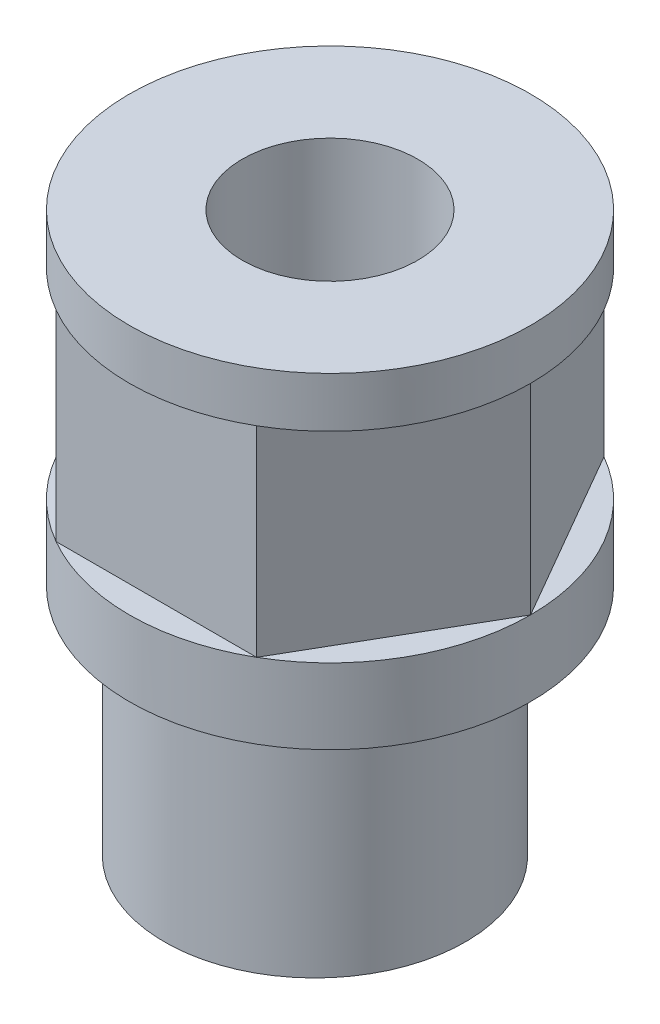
ISO-10303-21;
HEADER;
FILE_DESCRIPTION(('STEP AP214'),'2;1');
FILE_NAME('part.step','',(''),(''),'','','');
FILE_SCHEMA(('AUTOMOTIVE_DESIGN { 1 0 10303 214 1 1 1 1 }'));
ENDSEC;
DATA;
#1=APPLICATION_CONTEXT('core data for automotive mechanical design processes');
#2=APPLICATION_PROTOCOL_DEFINITION('international standard','automotive_design',2000,#1);
#3=PRODUCT_CONTEXT('',#1,'mechanical');
#4=PRODUCT('Part','Part','',(#3));
#5=PRODUCT_RELATED_PRODUCT_CATEGORY('part','',(#4));
#6=PRODUCT_DEFINITION_FORMATION('','',#4);
#7=PRODUCT_DEFINITION_CONTEXT('part definition',#1,'design');
#8=PRODUCT_DEFINITION('design','',#6,#7);
#9=PRODUCT_DEFINITION_SHAPE('','',#8);
#10=(LENGTH_UNIT() NAMED_UNIT(*) SI_UNIT(.MILLI.,.METRE.));
#11=(NAMED_UNIT(*) PLANE_ANGLE_UNIT() SI_UNIT($,.RADIAN.));
#12=(NAMED_UNIT(*) SI_UNIT($,.STERADIAN.) SOLID_ANGLE_UNIT());
#13=UNCERTAINTY_MEASURE_WITH_UNIT(LENGTH_MEASURE(1.E-05),#10,'distance_accuracy_value','');
#14=(GEOMETRIC_REPRESENTATION_CONTEXT(3) GLOBAL_UNCERTAINTY_ASSIGNED_CONTEXT((#13)) GLOBAL_UNIT_ASSIGNED_CONTEXT((#10,
#11,#12)) REPRESENTATION_CONTEXT('',''));
#15=CARTESIAN_POINT('',(0.,0.,0.));
#16=DIRECTION('',(0.,0.,1.));
#17=DIRECTION('',(1.,0.,0.));
#18=AXIS2_PLACEMENT_3D('',#15,#16,#17);
#19=CARTESIAN_POINT('',(5.07999999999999,5.08,8.7988181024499));
#20=DIRECTION('',(-0.866025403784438,0.,-0.5));
#21=DIRECTION('',(-0.5,0.,0.866025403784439));
#22=AXIS2_PLACEMENT_3D('',#19,#20,#21);
#23=PLANE('',#22);
#24=DIRECTION('',(0.5,0.,-0.866025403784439));
#25=VECTOR('',#24,1.);
#26=CARTESIAN_POINT('',(5.07999999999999,-5.08,8.7988181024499));
#27=LINE('',#26,#25);
#28=CARTESIAN_POINT('',(5.07999999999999,-5.08,8.79881810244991));
#29=VERTEX_POINT('',#28);
#30=CARTESIAN_POINT('',(10.16,-5.08,0.));
#31=VERTEX_POINT('',#30);
#32=EDGE_CURVE('E91',#29,#31,#27,.T.);
#33=ORIENTED_EDGE('',*,*,#32,.T.);
#34=DIRECTION('',(0.,-1.,0.));
#35=VECTOR('',#34,1.);
#36=CARTESIAN_POINT('',(10.16,5.08,0.));
#37=LINE('',#36,#35);
#38=CARTESIAN_POINT('',(10.16,5.08,0.));
#39=VERTEX_POINT('',#38);
#40=EDGE_CURVE('E11',#39,#31,#37,.T.);
#41=ORIENTED_EDGE('',*,*,#40,.F.);
#42=DIRECTION('',(0.5,0.,-0.866025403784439));
#43=VECTOR('',#42,1.);
#44=CARTESIAN_POINT('',(5.07999999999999,5.08,8.7988181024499));
#45=LINE('',#44,#43);
#46=CARTESIAN_POINT('',(5.07999999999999,5.08,8.7988181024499));
#47=VERTEX_POINT('',#46);
#48=EDGE_CURVE('E137',#47,#39,#45,.T.);
#49=ORIENTED_EDGE('',*,*,#48,.F.);
#50=DIRECTION('',(0.,-1.,0.));
#51=VECTOR('',#50,1.);
#52=CARTESIAN_POINT('',(5.07999999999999,5.08,8.7988181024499));
#53=LINE('',#52,#51);
#54=EDGE_CURVE('E118',#47,#29,#53,.T.);
#55=ORIENTED_EDGE('',*,*,#54,.T.);
#56=EDGE_LOOP('',(#33,#41,#49,#55));
#57=FACE_BOUND('',#56,.T.);
#58=ADVANCED_FACE('F32',(#57),#23,.F.);
#59=CARTESIAN_POINT('',(10.16,5.08,0.));
#60=DIRECTION('',(-0.866025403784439,0.,0.5));
#61=DIRECTION('',(0.5,0.,0.866025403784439));
#62=AXIS2_PLACEMENT_3D('',#59,#60,#61);
#63=PLANE('',#62);
#64=DIRECTION('',(-0.5,0.,-0.866025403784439));
#65=VECTOR('',#64,1.);
#66=CARTESIAN_POINT('',(10.16,-5.08,0.));
#67=LINE('',#66,#65);
#68=CARTESIAN_POINT('',(5.08,-5.08,-8.7988181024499));
#69=VERTEX_POINT('',#68);
#70=EDGE_CURVE('E82',#31,#69,#67,.T.);
#71=ORIENTED_EDGE('',*,*,#70,.T.);
#72=DIRECTION('',(0.,-1.,0.));
#73=VECTOR('',#72,1.);
#74=CARTESIAN_POINT('',(5.08,5.08,-8.7988181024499));
#75=LINE('',#74,#73);
#76=CARTESIAN_POINT('',(5.08,5.08,-8.7988181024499));
#77=VERTEX_POINT('',#76);
#78=EDGE_CURVE('E41',#77,#69,#75,.T.);
#79=ORIENTED_EDGE('',*,*,#78,.F.);
#80=DIRECTION('',(-0.5,0.,-0.866025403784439));
#81=VECTOR('',#80,1.);
#82=CARTESIAN_POINT('',(10.16,5.08,0.));
#83=LINE('',#82,#81);
#84=EDGE_CURVE('E113',#39,#77,#83,.T.);
#85=ORIENTED_EDGE('',*,*,#84,.F.);
#86=ORIENTED_EDGE('',*,*,#40,.T.);
#87=EDGE_LOOP('',(#71,#79,#85,#86));
#88=FACE_BOUND('',#87,.T.);
#89=ADVANCED_FACE('F111',(#88),#63,.F.);
#90=CARTESIAN_POINT('',(5.08,5.08,-8.7988181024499));
#91=DIRECTION('',(0.,0.,1.));
#92=DIRECTION('',(1.,0.,0.));
#93=AXIS2_PLACEMENT_3D('',#90,#91,#92);
#94=PLANE('',#93);
#95=DIRECTION('',(-1.,0.,0.));
#96=VECTOR('',#95,1.);
#97=CARTESIAN_POINT('',(5.08,-5.08,-8.7988181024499));
#98=LINE('',#97,#96);
#99=CARTESIAN_POINT('',(-5.07999999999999,-5.08,-8.79881810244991));
#100=VERTEX_POINT('',#99);
#101=EDGE_CURVE('E90',#69,#100,#98,.T.);
#102=ORIENTED_EDGE('',*,*,#101,.T.);
#103=DIRECTION('',(0.,-1.,0.));
#104=VECTOR('',#103,1.);
#105=CARTESIAN_POINT('',(-5.08,5.08,-8.7988181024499));
#106=LINE('',#105,#104);
#107=CARTESIAN_POINT('',(-5.08,5.08,-8.7988181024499));
#108=VERTEX_POINT('',#107);
#109=EDGE_CURVE('E143',#108,#100,#106,.T.);
#110=ORIENTED_EDGE('',*,*,#109,.F.);
#111=DIRECTION('',(-1.,0.,0.));
#112=VECTOR('',#111,1.);
#113=CARTESIAN_POINT('',(5.08,5.08,-8.7988181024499));
#114=LINE('',#113,#112);
#115=EDGE_CURVE('E150',#77,#108,#114,.T.);
#116=ORIENTED_EDGE('',*,*,#115,.F.);
#117=ORIENTED_EDGE('',*,*,#78,.T.);
#118=EDGE_LOOP('',(#102,#110,#116,#117));
#119=FACE_BOUND('',#118,.T.);
#120=ADVANCED_FACE('F148',(#119),#94,.F.);
#121=CARTESIAN_POINT('',(-5.08,5.08,-8.7988181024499));
#122=DIRECTION('',(0.866025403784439,0.,0.5));
#123=DIRECTION('',(0.5,0.,-0.866025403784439));
#124=AXIS2_PLACEMENT_3D('',#121,#122,#123);
#125=PLANE('',#124);
#126=DIRECTION('',(-0.5,0.,0.866025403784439));
#127=VECTOR('',#126,1.);
#128=CARTESIAN_POINT('',(-5.08,-5.08,-8.7988181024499));
#129=LINE('',#128,#127);
#130=CARTESIAN_POINT('',(-10.16,-5.08,0.));
#131=VERTEX_POINT('',#130);
#132=EDGE_CURVE('E130',#100,#131,#129,.T.);
#133=ORIENTED_EDGE('',*,*,#132,.T.);
#134=DIRECTION('',(0.,-1.,0.));
#135=VECTOR('',#134,1.);
#136=CARTESIAN_POINT('',(-10.16,5.08,0.));
#137=LINE('',#136,#135);
#138=CARTESIAN_POINT('',(-10.16,5.08,0.));
#139=VERTEX_POINT('',#138);
#140=EDGE_CURVE('E140',#139,#131,#137,.T.);
#141=ORIENTED_EDGE('',*,*,#140,.F.);
#142=DIRECTION('',(-0.5,0.,0.866025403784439));
#143=VECTOR('',#142,1.);
#144=CARTESIAN_POINT('',(-5.08,5.08,-8.7988181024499));
#145=LINE('',#144,#143);
#146=EDGE_CURVE('E155',#108,#139,#145,.T.);
#147=ORIENTED_EDGE('',*,*,#146,.F.);
#148=ORIENTED_EDGE('',*,*,#109,.T.);
#149=EDGE_LOOP('',(#133,#141,#147,#148));
#150=FACE_BOUND('',#149,.T.);
#151=ADVANCED_FACE('F203',(#150),#125,.F.);
#152=CARTESIAN_POINT('',(-10.16,5.08,0.));
#153=DIRECTION('',(0.866025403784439,0.,-0.5));
#154=DIRECTION('',(-0.5,0.,-0.866025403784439));
#155=AXIS2_PLACEMENT_3D('',#152,#153,#154);
#156=PLANE('',#155);
#157=DIRECTION('',(0.5,0.,0.866025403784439));
#158=VECTOR('',#157,1.);
#159=CARTESIAN_POINT('',(-10.16,-5.08,0.));
#160=LINE('',#159,#158);
#161=CARTESIAN_POINT('',(-5.08000000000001,-5.08,8.79881810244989));
#162=VERTEX_POINT('',#161);
#163=EDGE_CURVE('E133',#131,#162,#160,.T.);
#164=ORIENTED_EDGE('',*,*,#163,.T.);
#165=DIRECTION('',(0.,-1.,0.));
#166=VECTOR('',#165,1.);
#167=CARTESIAN_POINT('',(-5.08000000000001,5.08,8.7988181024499));
#168=LINE('',#167,#166);
#169=CARTESIAN_POINT('',(-5.08000000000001,5.08,8.7988181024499));
#170=VERTEX_POINT('',#169);
#171=EDGE_CURVE('E48',#170,#162,#168,.T.);
#172=ORIENTED_EDGE('',*,*,#171,.F.);
#173=DIRECTION('',(0.5,0.,0.866025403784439));
#174=VECTOR('',#173,1.);
#175=CARTESIAN_POINT('',(-10.16,5.08,0.));
#176=LINE('',#175,#174);
#177=EDGE_CURVE('E178',#139,#170,#176,.T.);
#178=ORIENTED_EDGE('',*,*,#177,.F.);
#179=ORIENTED_EDGE('',*,*,#140,.T.);
#180=EDGE_LOOP('',(#164,#172,#178,#179));
#181=FACE_BOUND('',#180,.T.);
#182=ADVANCED_FACE('F201',(#181),#156,.F.);
#183=CARTESIAN_POINT('',(-5.08000000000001,5.08,8.7988181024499));
#184=DIRECTION('',(0.,0.,-1.));
#185=DIRECTION('',(-1.,0.,0.));
#186=AXIS2_PLACEMENT_3D('',#183,#184,#185);
#187=PLANE('',#186);
#188=DIRECTION('',(1.,0.,0.));
#189=VECTOR('',#188,1.);
#190=CARTESIAN_POINT('',(-5.08000000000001,-5.08,8.7988181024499));
#191=LINE('',#190,#189);
#192=EDGE_CURVE('E135',#162,#29,#191,.T.);
#193=ORIENTED_EDGE('',*,*,#192,.T.);
#194=ORIENTED_EDGE('',*,*,#54,.F.);
#195=DIRECTION('',(1.,0.,0.));
#196=VECTOR('',#195,1.);
#197=CARTESIAN_POINT('',(-5.08000000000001,5.08,8.7988181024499));
#198=LINE('',#197,#196);
#199=EDGE_CURVE('E125',#170,#47,#198,.T.);
#200=ORIENTED_EDGE('',*,*,#199,.F.);
#201=ORIENTED_EDGE('',*,*,#171,.T.);
#202=EDGE_LOOP('',(#193,#194,#200,#201));
#203=FACE_BOUND('',#202,.T.);
#204=ADVANCED_FACE('F191',(#203),#187,.F.);
#205=CARTESIAN_POINT('',(0.,5.08,0.));
#206=DIRECTION('',(0.,1.,0.));
#207=DIRECTION('',(0.,0.,1.));
#208=AXIS2_PLACEMENT_3D('',#205,#206,#207);
#209=PLANE('',#208);
#210=CARTESIAN_POINT('',(0.,5.08,0.));
#211=DIRECTION('',(0.,1.,0.));
#212=DIRECTION('',(0.,0.,1.));
#213=AXIS2_PLACEMENT_3D('',#210,#211,#212);
#214=CIRCLE('',#213,10.16);
#215=EDGE_CURVE('E122',#47,#39,#214,.T.);
#216=ORIENTED_EDGE('',*,*,#215,.F.);
#217=ORIENTED_EDGE('',*,*,#48,.T.);
#218=EDGE_LOOP('',(#216,#217));
#219=FACE_BOUND('',#218,.T.);
#220=ADVANCED_FACE('F190',(#219),#209,.F.);
#221=EDGE_CURVE('E161',#39,#77,#214,.T.);
#222=ORIENTED_EDGE('',*,*,#221,.F.);
#223=ORIENTED_EDGE('',*,*,#84,.T.);
#224=EDGE_LOOP('',(#222,#223));
#225=FACE_BOUND('',#224,.T.);
#226=ADVANCED_FACE('F159',(#225),#209,.F.);
#227=EDGE_CURVE('E165',#77,#108,#214,.T.);
#228=ORIENTED_EDGE('',*,*,#227,.F.);
#229=ORIENTED_EDGE('',*,*,#115,.T.);
#230=EDGE_LOOP('',(#228,#229));
#231=FACE_BOUND('',#230,.T.);
#232=ADVANCED_FACE('F166',(#231),#209,.F.);
#233=EDGE_CURVE('E169',#108,#139,#214,.T.);
#234=ORIENTED_EDGE('',*,*,#233,.F.);
#235=ORIENTED_EDGE('',*,*,#146,.T.);
#236=EDGE_LOOP('',(#234,#235));
#237=FACE_BOUND('',#236,.T.);
#238=ADVANCED_FACE('F372',(#237),#209,.F.);
#239=EDGE_CURVE('E188',#139,#170,#214,.T.);
#240=ORIENTED_EDGE('',*,*,#239,.F.);
#241=ORIENTED_EDGE('',*,*,#177,.T.);
#242=EDGE_LOOP('',(#240,#241));
#243=FACE_BOUND('',#242,.T.);
#244=ADVANCED_FACE('F269',(#243),#209,.F.);
#245=CARTESIAN_POINT('',(0.,7.62,0.));
#246=DIRECTION('',(0.,-1.,0.));
#247=DIRECTION('',(0.,0.,-1.));
#248=AXIS2_PLACEMENT_3D('',#245,#246,#247);
#249=CYLINDRICAL_SURFACE('',#248,10.16);
#250=CARTESIAN_POINT('',(0.,7.62,0.));
#251=DIRECTION('',(0.,1.,0.));
#252=DIRECTION('',(0.,0.,1.));
#253=AXIS2_PLACEMENT_3D('',#250,#251,#252);
#254=CIRCLE('',#253,10.16);
#255=CARTESIAN_POINT('',(0.,7.62,10.16));
#256=VERTEX_POINT('',#255);
#257=EDGE_CURVE('E119',#256,#256,#254,.T.);
#258=ORIENTED_EDGE('',*,*,#257,.F.);
#259=EDGE_LOOP('',(#258));
#260=FACE_BOUND('',#259,.T.);
#261=ORIENTED_EDGE('',*,*,#215,.T.);
#262=ORIENTED_EDGE('',*,*,#221,.T.);
#263=ORIENTED_EDGE('',*,*,#227,.T.);
#264=ORIENTED_EDGE('',*,*,#233,.T.);
#265=ORIENTED_EDGE('',*,*,#239,.T.);
#266=EDGE_CURVE('E174',#170,#47,#214,.T.);
#267=ORIENTED_EDGE('',*,*,#266,.T.);
#268=EDGE_LOOP('',(#261,#262,#263,#264,#265,#267));
#269=FACE_BOUND('',#268,.T.);
#270=ADVANCED_FACE('F171',(#260,#269),#249,.T.);
#271=CARTESIAN_POINT('',(0.,7.62,0.));
#272=DIRECTION('',(0.,1.,0.));
#273=DIRECTION('',(0.,0.,1.));
#274=AXIS2_PLACEMENT_3D('',#271,#272,#273);
#275=PLANE('',#274);
#276=CARTESIAN_POINT('',(0.,7.62,0.));
#277=DIRECTION('',(0.,1.,0.));
#278=DIRECTION('',(0.,0.,1.));
#279=AXIS2_PLACEMENT_3D('',#276,#277,#278);
#280=CIRCLE('',#279,4.445);
#281=CARTESIAN_POINT('',(0.,7.62,4.445));
#282=VERTEX_POINT('',#281);
#283=EDGE_CURVE('E217',#282,#282,#280,.T.);
#284=ORIENTED_EDGE('',*,*,#283,.F.);
#285=EDGE_LOOP('',(#284));
#286=FACE_BOUND('',#285,.T.);
#287=ORIENTED_EDGE('',*,*,#257,.T.);
#288=EDGE_LOOP('',(#287));
#289=FACE_BOUND('',#288,.T.);
#290=ADVANCED_FACE('F268',(#286,#289),#275,.T.);
#291=ORIENTED_EDGE('',*,*,#266,.F.);
#292=ORIENTED_EDGE('',*,*,#199,.T.);
#293=EDGE_LOOP('',(#291,#292));
#294=FACE_BOUND('',#293,.T.);
#295=ADVANCED_FACE('F185',(#294),#209,.F.);
#296=CARTESIAN_POINT('',(0.,-5.08,0.));
#297=DIRECTION('',(0.,-1.,0.));
#298=DIRECTION('',(0.,0.,-1.));
#299=AXIS2_PLACEMENT_3D('',#296,#297,#298);
#300=PLANE('',#299);
#301=ORIENTED_EDGE('',*,*,#32,.F.);
#302=CARTESIAN_POINT('',(0.,-5.08,0.));
#303=DIRECTION('',(0.,-1.,0.));
#304=DIRECTION('',(0.,0.,-1.));
#305=AXIS2_PLACEMENT_3D('',#302,#303,#304);
#306=CIRCLE('',#305,10.16);
#307=EDGE_CURVE('E95',#31,#29,#306,.T.);
#308=ORIENTED_EDGE('',*,*,#307,.F.);
#309=EDGE_LOOP('',(#301,#308));
#310=FACE_BOUND('',#309,.T.);
#311=ADVANCED_FACE('F96',(#310),#300,.F.);
#312=ORIENTED_EDGE('',*,*,#192,.F.);
#313=EDGE_CURVE('E102',#29,#162,#306,.T.);
#314=ORIENTED_EDGE('',*,*,#313,.F.);
#315=EDGE_LOOP('',(#312,#314));
#316=FACE_BOUND('',#315,.T.);
#317=ADVANCED_FACE('F194',(#316),#300,.F.);
#318=ORIENTED_EDGE('',*,*,#163,.F.);
#319=EDGE_CURVE('E197',#162,#131,#306,.T.);
#320=ORIENTED_EDGE('',*,*,#319,.F.);
#321=EDGE_LOOP('',(#318,#320));
#322=FACE_BOUND('',#321,.T.);
#323=ADVANCED_FACE('F198',(#322),#300,.F.);
#324=ORIENTED_EDGE('',*,*,#132,.F.);
#325=EDGE_CURVE('E200',#131,#100,#306,.T.);
#326=ORIENTED_EDGE('',*,*,#325,.F.);
#327=EDGE_LOOP('',(#324,#326));
#328=FACE_BOUND('',#327,.T.);
#329=ADVANCED_FACE('F205',(#328),#300,.F.);
#330=ORIENTED_EDGE('',*,*,#101,.F.);
#331=EDGE_CURVE('E107',#100,#69,#306,.T.);
#332=ORIENTED_EDGE('',*,*,#331,.F.);
#333=EDGE_LOOP('',(#330,#332));
#334=FACE_BOUND('',#333,.T.);
#335=ADVANCED_FACE('F207',(#334),#300,.F.);
#336=ORIENTED_EDGE('',*,*,#70,.F.);
#337=EDGE_CURVE('E86',#69,#31,#306,.T.);
#338=ORIENTED_EDGE('',*,*,#337,.F.);
#339=EDGE_LOOP('',(#336,#338));
#340=FACE_BOUND('',#339,.T.);
#341=ADVANCED_FACE('F84',(#340),#300,.F.);
#342=CARTESIAN_POINT('',(0.,-8.89,0.));
#343=DIRECTION('',(0.,1.,0.));
#344=DIRECTION('',(0.,0.,1.));
#345=AXIS2_PLACEMENT_3D('',#342,#343,#344);
#346=CYLINDRICAL_SURFACE('',#345,10.16);
#347=CARTESIAN_POINT('',(0.,-8.89,0.));
#348=DIRECTION('',(0.,-1.,0.));
#349=DIRECTION('',(0.,0.,-1.));
#350=AXIS2_PLACEMENT_3D('',#347,#348,#349);
#351=CIRCLE('',#350,10.16);
#352=CARTESIAN_POINT('',(0.,-8.89,-10.16));
#353=VERTEX_POINT('',#352);
#354=EDGE_CURVE('E109',#353,#353,#351,.T.);
#355=ORIENTED_EDGE('',*,*,#354,.F.);
#356=EDGE_LOOP('',(#355));
#357=FACE_BOUND('',#356,.T.);
#358=ORIENTED_EDGE('',*,*,#337,.T.);
#359=ORIENTED_EDGE('',*,*,#307,.T.);
#360=ORIENTED_EDGE('',*,*,#313,.T.);
#361=ORIENTED_EDGE('',*,*,#319,.T.);
#362=ORIENTED_EDGE('',*,*,#325,.T.);
#363=ORIENTED_EDGE('',*,*,#331,.T.);
#364=EDGE_LOOP('',(#358,#359,#360,#361,#362,#363));
#365=FACE_BOUND('',#364,.T.);
#366=ADVANCED_FACE('F104',(#357,#365),#346,.T.);
#367=CARTESIAN_POINT('',(0.,-8.89,0.));
#368=DIRECTION('',(0.,-1.,0.));
#369=DIRECTION('',(0.,0.,-1.));
#370=AXIS2_PLACEMENT_3D('',#367,#368,#369);
#371=PLANE('',#370);
#372=CARTESIAN_POINT('',(0.,-8.89,0.762));
#373=DIRECTION('',(0.,-1.,0.));
#374=DIRECTION('',(0.,0.,-1.));
#375=AXIS2_PLACEMENT_3D('',#372,#373,#374);
#376=CIRCLE('',#375,7.62);
#377=CARTESIAN_POINT('',(0.,-8.89,-6.858));
#378=VERTEX_POINT('',#377);
#379=EDGE_CURVE('E212',#378,#378,#376,.T.);
#380=ORIENTED_EDGE('',*,*,#379,.F.);
#381=EDGE_LOOP('',(#380));
#382=FACE_BOUND('',#381,.T.);
#383=ORIENTED_EDGE('',*,*,#354,.T.);
#384=EDGE_LOOP('',(#383));
#385=FACE_BOUND('',#384,.T.);
#386=ADVANCED_FACE('F235',(#382,#385),#371,.T.);
#387=CARTESIAN_POINT('',(0.,-20.32,0.762));
#388=DIRECTION('',(0.,1.,0.));
#389=DIRECTION('',(0.,0.,1.));
#390=AXIS2_PLACEMENT_3D('',#387,#388,#389);
#391=CYLINDRICAL_SURFACE('',#390,7.62);
#392=CARTESIAN_POINT('',(0.,-20.32,0.762));
#393=DIRECTION('',(0.,-1.,0.));
#394=DIRECTION('',(0.,0.,-1.));
#395=AXIS2_PLACEMENT_3D('',#392,#393,#394);
#396=CIRCLE('',#395,7.62);
#397=CARTESIAN_POINT('',(0.,-20.32,-6.858));
#398=VERTEX_POINT('',#397);
#399=EDGE_CURVE('E208',#398,#398,#396,.T.);
#400=ORIENTED_EDGE('',*,*,#399,.F.);
#401=EDGE_LOOP('',(#400));
#402=FACE_BOUND('',#401,.T.);
#403=ORIENTED_EDGE('',*,*,#379,.T.);
#404=EDGE_LOOP('',(#403));
#405=FACE_BOUND('',#404,.T.);
#406=ADVANCED_FACE('F229',(#402,#405),#391,.T.);
#407=CARTESIAN_POINT('',(0.,-20.32,0.762));
#408=DIRECTION('',(0.,-1.,0.));
#409=DIRECTION('',(0.,0.,-1.));
#410=AXIS2_PLACEMENT_3D('',#407,#408,#409);
#411=PLANE('',#410);
#412=CARTESIAN_POINT('',(0.,-20.32,0.));
#413=DIRECTION('',(0.,-1.,0.));
#414=DIRECTION('',(0.,0.,-1.));
#415=AXIS2_PLACEMENT_3D('',#412,#413,#414);
#416=CIRCLE('',#415,4.445);
#417=CARTESIAN_POINT('',(0.,-20.32,4.445));
#418=VERTEX_POINT('',#417);
#419=EDGE_CURVE('E35',#418,#418,#416,.T.);
#420=ORIENTED_EDGE('',*,*,#419,.F.);
#421=EDGE_LOOP('',(#420));
#422=FACE_BOUND('',#421,.T.);
#423=ORIENTED_EDGE('',*,*,#399,.T.);
#424=EDGE_LOOP('',(#423));
#425=FACE_BOUND('',#424,.T.);
#426=ADVANCED_FACE('F226',(#422,#425),#411,.T.);
#427=CARTESIAN_POINT('',(0.,-23.622,0.));
#428=DIRECTION('',(0.,1.,0.));
#429=DIRECTION('',(0.,0.,1.));
#430=AXIS2_PLACEMENT_3D('',#427,#428,#429);
#431=CYLINDRICAL_SURFACE('',#430,4.445);
#432=CARTESIAN_POINT('',(0.,-20.32,4.445));
#433=CARTESIAN_POINT('',(0.,-20.0289583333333,4.445));
#434=CARTESIAN_POINT('',(0.,-19.7379166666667,4.445));
#435=CARTESIAN_POINT('',(0.,-19.1558333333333,4.445));
#436=CARTESIAN_POINT('',(0.,-18.8647916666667,4.445));
#437=CARTESIAN_POINT('',(0.,-18.2827083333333,4.445));
#438=CARTESIAN_POINT('',(0.,-17.9916666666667,4.445));
#439=CARTESIAN_POINT('',(0.,-17.4095833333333,4.445));
#440=CARTESIAN_POINT('',(0.,-17.1185416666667,4.445));
#441=CARTESIAN_POINT('',(0.,-16.5364583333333,4.445));
#442=CARTESIAN_POINT('',(0.,-16.2454166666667,4.445));
#443=CARTESIAN_POINT('',(0.,-15.6633333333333,4.445));
#444=CARTESIAN_POINT('',(0.,-15.3722916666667,4.445));
#445=CARTESIAN_POINT('',(0.,-14.7902083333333,4.445));
#446=CARTESIAN_POINT('',(0.,-14.4991666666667,4.445));
#447=CARTESIAN_POINT('',(0.,-13.9170833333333,4.445));
#448=CARTESIAN_POINT('',(0.,-13.6260416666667,4.445));
#449=CARTESIAN_POINT('',(0.,-13.0439583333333,4.445));
#450=CARTESIAN_POINT('',(0.,-12.7529166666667,4.445));
#451=CARTESIAN_POINT('',(0.,-12.1708333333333,4.445));
#452=CARTESIAN_POINT('',(0.,-11.8797916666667,4.445));
#453=CARTESIAN_POINT('',(0.,-11.2977083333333,4.445));
#454=CARTESIAN_POINT('',(0.,-11.0066666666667,4.445));
#455=CARTESIAN_POINT('',(0.,-10.4245833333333,4.445));
#456=CARTESIAN_POINT('',(0.,-10.1335416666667,4.445));
#457=CARTESIAN_POINT('',(0.,-9.55145833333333,4.445));
#458=CARTESIAN_POINT('',(0.,-9.26041666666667,4.445));
#459=CARTESIAN_POINT('',(0.,-8.67833333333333,4.445));
#460=CARTESIAN_POINT('',(0.,-8.38729166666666,4.445));
#461=CARTESIAN_POINT('',(0.,-7.80520833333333,4.445));
#462=CARTESIAN_POINT('',(0.,-7.51416666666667,4.445));
#463=CARTESIAN_POINT('',(0.,-6.93208333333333,4.445));
#464=CARTESIAN_POINT('',(0.,-6.64104166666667,4.445));
#465=CARTESIAN_POINT('',(0.,-6.05895833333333,4.445));
#466=CARTESIAN_POINT('',(0.,-5.76791666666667,4.445));
#467=CARTESIAN_POINT('',(0.,-5.18583333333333,4.445));
#468=CARTESIAN_POINT('',(0.,-4.89479166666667,4.445));
#469=CARTESIAN_POINT('',(0.,-4.31270833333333,4.445));
#470=CARTESIAN_POINT('',(0.,-4.02166666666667,4.445));
#471=CARTESIAN_POINT('',(0.,-3.43958333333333,4.445));
#472=CARTESIAN_POINT('',(0.,-3.14854166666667,4.445));
#473=CARTESIAN_POINT('',(0.,-2.56645833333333,4.445));
#474=CARTESIAN_POINT('',(0.,-2.27541666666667,4.445));
#475=CARTESIAN_POINT('',(0.,-1.69333333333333,4.445));
#476=CARTESIAN_POINT('',(0.,-1.40229166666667,4.445));
#477=CARTESIAN_POINT('',(0.,-0.820208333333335,4.445));
#478=CARTESIAN_POINT('',(0.,-0.529166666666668,4.445));
#479=CARTESIAN_POINT('',(0.,0.0529166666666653,4.445));
#480=CARTESIAN_POINT('',(0.,0.343958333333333,4.445));
#481=CARTESIAN_POINT('',(0.,0.926041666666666,4.445));
#482=CARTESIAN_POINT('',(0.,1.21708333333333,4.445));
#483=CARTESIAN_POINT('',(0.,1.79916666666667,4.445));
#484=CARTESIAN_POINT('',(0.,2.09020833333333,4.445));
#485=CARTESIAN_POINT('',(0.,2.67229166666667,4.445));
#486=CARTESIAN_POINT('',(0.,2.96333333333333,4.445));
#487=CARTESIAN_POINT('',(0.,3.54541666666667,4.445));
#488=CARTESIAN_POINT('',(0.,3.83645833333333,4.445));
#489=CARTESIAN_POINT('',(0.,4.41854166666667,4.445));
#490=CARTESIAN_POINT('',(0.,4.70958333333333,4.445));
#491=CARTESIAN_POINT('',(0.,5.29166666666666,4.445));
#492=CARTESIAN_POINT('',(0.,5.58270833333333,4.445));
#493=CARTESIAN_POINT('',(0.,6.16479166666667,4.445));
#494=CARTESIAN_POINT('',(0.,6.45583333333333,4.445));
#495=CARTESIAN_POINT('',(0.,7.03791666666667,4.445));
#496=CARTESIAN_POINT('',(0.,7.32895833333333,4.445));
#497=CARTESIAN_POINT('',(0.,7.62,4.445));
#498=B_SPLINE_CURVE_WITH_KNOTS('',3,(#432,#433,#434,#435,#436,#437,#438,#439,#440,#441,#442,
#443,#444,#445,#446,#447,#448,#449,#450,#451,#452,#453,#454,#455,#456,#457,#458,#459,#460,#461,
#462,#463,#464,#465,#466,#467,#468,#469,#470,#471,#472,#473,#474,#475,#476,#477,#478,#479,#480,
#481,#482,#483,#484,#485,#486,#487,#488,#489,#490,#491,#492,#493,#494,#495,#496,#497),
.UNSPECIFIED.,.F.,.F.,(4,2,2,2,2,2,2,2,2,2,2,2,2,2,2,2,2,2,2,2,2,2,2,2,2,2,2,2,2,2,2,2,4),(0.,
0.873124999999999,1.74625,2.619375,3.4925,4.365625,5.23875,6.111875,6.985,7.85812499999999,
8.73125,9.604375,10.4775,11.350625,12.22375,13.096875,13.97,14.843125,15.71625,16.589375,
17.4625,18.335625,19.20875,20.081875,20.955,21.828125,22.70125,23.574375,24.4475,25.320625,
26.19375,27.066875,27.94),.UNSPECIFIED.);
#499=EDGE_CURVE('BSEAM224',#418,#282,#498,.T.);
#500=ORIENTED_EDGE('',*,*,#419,.T.);
#501=ORIENTED_EDGE('',*,*,#283,.T.);
#502=ORIENTED_EDGE('',*,*,#499,.T.);
#503=ORIENTED_EDGE('',*,*,#499,.F.);
#504=EDGE_LOOP('',(#500,#502,#501,#503));
#505=FACE_BOUND('',#504,.T.);
#506=ADVANCED_FACE('F224',(#505),#431,.F.);
#507=CLOSED_SHELL('',(#58,#89,#120,#151,#182,#204,#220,#226,#232,#238,#244,#270,#290,#295,#311,
#317,#323,#329,#335,#341,#366,#386,#406,#426,#506));
#508=MANIFOLD_SOLID_BREP('B2',#507);
#509=ADVANCED_BREP_SHAPE_REPRESENTATION('',(#18,#508),#14);
#510=SHAPE_DEFINITION_REPRESENTATION(#9,#509);
ENDSEC;
END-ISO-10303-21;
